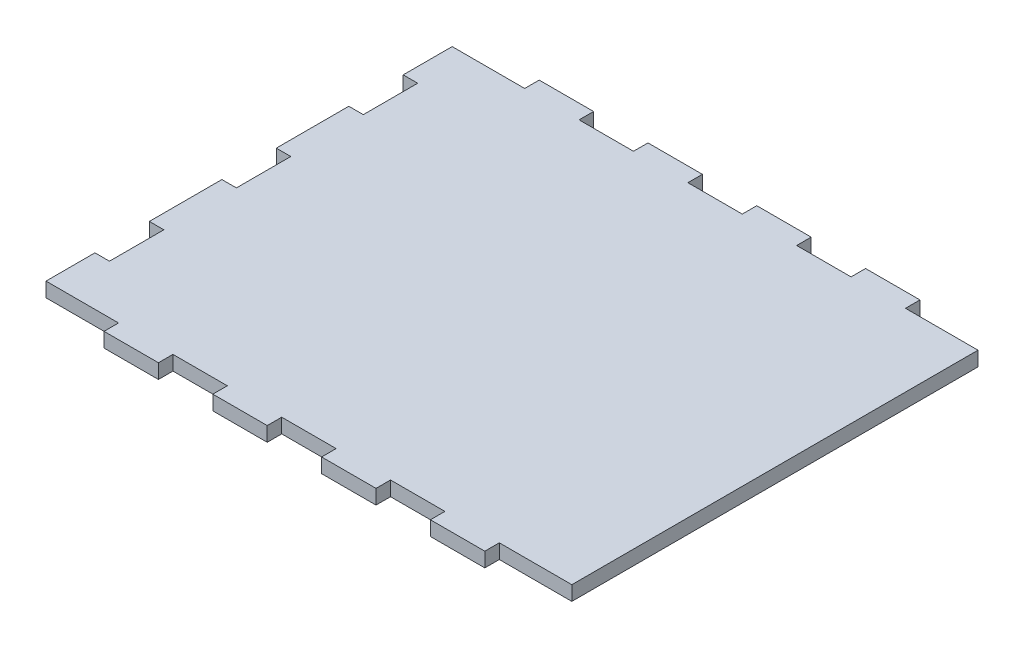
ISO-10303-21;
HEADER;
FILE_DESCRIPTION(('STEP AP214'),'2;1');
FILE_NAME('part.step','',(''),(''),'','','');
FILE_SCHEMA(('AUTOMOTIVE_DESIGN { 1 0 10303 214 1 1 1 1 }'));
ENDSEC;
DATA;
#1=APPLICATION_CONTEXT('core data for automotive mechanical design processes');
#2=APPLICATION_PROTOCOL_DEFINITION('international standard','automotive_design',2000,#1);
#3=PRODUCT_CONTEXT('',#1,'mechanical');
#4=PRODUCT('Part','Part','',(#3));
#5=PRODUCT_RELATED_PRODUCT_CATEGORY('part','',(#4));
#6=PRODUCT_DEFINITION_FORMATION('','',#4);
#7=PRODUCT_DEFINITION_CONTEXT('part definition',#1,'design');
#8=PRODUCT_DEFINITION('design','',#6,#7);
#9=PRODUCT_DEFINITION_SHAPE('','',#8);
#10=(LENGTH_UNIT() NAMED_UNIT(*) SI_UNIT(.MILLI.,.METRE.));
#11=(NAMED_UNIT(*) PLANE_ANGLE_UNIT() SI_UNIT($,.RADIAN.));
#12=(NAMED_UNIT(*) SI_UNIT($,.STERADIAN.) SOLID_ANGLE_UNIT());
#13=UNCERTAINTY_MEASURE_WITH_UNIT(LENGTH_MEASURE(1.E-05),#10,'distance_accuracy_value','');
#14=(GEOMETRIC_REPRESENTATION_CONTEXT(3) GLOBAL_UNCERTAINTY_ASSIGNED_CONTEXT((#13)) GLOBAL_UNIT_ASSIGNED_CONTEXT((#10,
#11,#12)) REPRESENTATION_CONTEXT('',''));
#15=CARTESIAN_POINT('',(0.,0.,0.));
#16=DIRECTION('',(0.,0.,1.));
#17=DIRECTION('',(1.,0.,0.));
#18=AXIS2_PLACEMENT_3D('',#15,#16,#17);
#19=CARTESIAN_POINT('',(0.,4.,0.));
#20=DIRECTION('',(1.,0.,0.));
#21=DIRECTION('',(0.,0.,-1.));
#22=AXIS2_PLACEMENT_3D('',#19,#20,#21);
#23=PLANE('',#22);
#24=DIRECTION('',(0.,1.,0.));
#25=VECTOR('',#24,1.);
#26=CARTESIAN_POINT('',(0.,0.,-116.));
#27=LINE('',#26,#25);
#28=CARTESIAN_POINT('',(0.,0.,-116.));
#29=VERTEX_POINT('',#28);
#30=CARTESIAN_POINT('',(0.,4.,-116.));
#31=VERTEX_POINT('',#30);
#32=EDGE_CURVE('E355',#29,#31,#27,.T.);
#33=ORIENTED_EDGE('',*,*,#32,.F.);
#34=DIRECTION('',(0.,0.,1.));
#35=VECTOR('',#34,1.);
#36=CARTESIAN_POINT('',(0.,0.,0.));
#37=LINE('',#36,#35);
#38=CARTESIAN_POINT('',(0.,0.,-102.5));
#39=VERTEX_POINT('',#38);
#40=EDGE_CURVE('E367',#29,#39,#37,.T.);
#41=ORIENTED_EDGE('',*,*,#40,.T.);
#42=DIRECTION('',(0.,1.,0.));
#43=VECTOR('',#42,1.);
#44=CARTESIAN_POINT('',(0.,0.,-102.5));
#45=LINE('',#44,#43);
#46=CARTESIAN_POINT('',(0.,4.,-102.5));
#47=VERTEX_POINT('',#46);
#48=EDGE_CURVE('E566',#39,#47,#45,.T.);
#49=ORIENTED_EDGE('',*,*,#48,.T.);
#50=DIRECTION('',(0.,0.,1.));
#51=VECTOR('',#50,1.);
#52=CARTESIAN_POINT('',(0.,4.,0.));
#53=LINE('',#52,#51);
#54=EDGE_CURVE('E369',#31,#47,#53,.T.);
#55=ORIENTED_EDGE('',*,*,#54,.F.);
#56=EDGE_LOOP('',(#33,#41,#49,#55));
#57=FACE_BOUND('',#56,.T.);
#58=ADVANCED_FACE('F45',(#57),#23,.F.);
#59=CARTESIAN_POINT('',(145.,4.,0.));
#60=DIRECTION('',(-1.,0.,0.));
#61=DIRECTION('',(0.,0.,1.));
#62=AXIS2_PLACEMENT_3D('',#59,#60,#61);
#63=PLANE('',#62);
#64=DIRECTION('',(0.,1.,0.));
#65=VECTOR('',#64,1.);
#66=CARTESIAN_POINT('',(145.,0.,-116.));
#67=LINE('',#66,#65);
#68=CARTESIAN_POINT('',(145.,0.,-116.));
#69=VERTEX_POINT('',#68);
#70=CARTESIAN_POINT('',(145.,4.,-116.));
#71=VERTEX_POINT('',#70);
#72=EDGE_CURVE('E485',#69,#71,#67,.T.);
#73=ORIENTED_EDGE('',*,*,#72,.T.);
#74=DIRECTION('',(0.,0.,-1.));
#75=VECTOR('',#74,1.);
#76=CARTESIAN_POINT('',(145.,4.,0.));
#77=LINE('',#76,#75);
#78=CARTESIAN_POINT('',(145.,4.,-4.));
#79=VERTEX_POINT('',#78);
#80=EDGE_CURVE('E421',#79,#71,#77,.T.);
#81=ORIENTED_EDGE('',*,*,#80,.F.);
#82=DIRECTION('',(0.,1.,0.));
#83=VECTOR('',#82,1.);
#84=CARTESIAN_POINT('',(145.,0.,-4.));
#85=LINE('',#84,#83);
#86=CARTESIAN_POINT('',(145.,0.,-4.));
#87=VERTEX_POINT('',#86);
#88=EDGE_CURVE('E747',#87,#79,#85,.T.);
#89=ORIENTED_EDGE('',*,*,#88,.F.);
#90=DIRECTION('',(0.,0.,-1.));
#91=VECTOR('',#90,1.);
#92=CARTESIAN_POINT('',(145.,0.,0.));
#93=LINE('',#92,#91);
#94=EDGE_CURVE('E837',#87,#69,#93,.T.);
#95=ORIENTED_EDGE('',*,*,#94,.T.);
#96=EDGE_LOOP('',(#73,#81,#89,#95));
#97=FACE_BOUND('',#96,.T.);
#98=ADVANCED_FACE('F883',(#97),#63,.F.);
#99=CARTESIAN_POINT('',(0.,4.,-120.));
#100=DIRECTION('',(0.,0.,1.));
#101=DIRECTION('',(1.,0.,0.));
#102=AXIS2_PLACEMENT_3D('',#99,#100,#101);
#103=PLANE('',#102);
#104=DIRECTION('',(0.,1.,0.));
#105=VECTOR('',#104,1.);
#106=CARTESIAN_POINT('',(20.,0.,-120.));
#107=LINE('',#106,#105);
#108=CARTESIAN_POINT('',(20.,0.,-120.));
#109=VERTEX_POINT('',#108);
#110=CARTESIAN_POINT('',(20.,4.,-120.));
#111=VERTEX_POINT('',#110);
#112=EDGE_CURVE('E520',#109,#111,#107,.T.);
#113=ORIENTED_EDGE('',*,*,#112,.T.);
#114=DIRECTION('',(-1.,0.,0.));
#115=VECTOR('',#114,1.);
#116=CARTESIAN_POINT('',(0.,4.,-120.));
#117=LINE('',#116,#115);
#118=CARTESIAN_POINT('',(35.,4.,-120.));
#119=VERTEX_POINT('',#118);
#120=EDGE_CURVE('E57',#119,#111,#117,.T.);
#121=ORIENTED_EDGE('',*,*,#120,.F.);
#122=DIRECTION('',(0.,1.,0.));
#123=VECTOR('',#122,1.);
#124=CARTESIAN_POINT('',(35.,0.,-120.));
#125=LINE('',#124,#123);
#126=CARTESIAN_POINT('',(35.,0.,-120.));
#127=VERTEX_POINT('',#126);
#128=EDGE_CURVE('E362',#127,#119,#125,.T.);
#129=ORIENTED_EDGE('',*,*,#128,.F.);
#130=DIRECTION('',(-1.,0.,0.));
#131=VECTOR('',#130,1.);
#132=CARTESIAN_POINT('',(0.,0.,-120.));
#133=LINE('',#132,#131);
#134=EDGE_CURVE('E49',#127,#109,#133,.T.);
#135=ORIENTED_EDGE('',*,*,#134,.T.);
#136=EDGE_LOOP('',(#113,#121,#129,#135));
#137=FACE_BOUND('',#136,.T.);
#138=ADVANCED_FACE('F889',(#137),#103,.F.);
#139=DIRECTION('',(0.,1.,0.));
#140=VECTOR('',#139,1.);
#141=CARTESIAN_POINT('',(50.,0.,-120.));
#142=LINE('',#141,#140);
#143=CARTESIAN_POINT('',(50.,0.,-120.));
#144=VERTEX_POINT('',#143);
#145=CARTESIAN_POINT('',(50.,4.,-120.));
#146=VERTEX_POINT('',#145);
#147=EDGE_CURVE('E939',#144,#146,#142,.T.);
#148=ORIENTED_EDGE('',*,*,#147,.T.);
#149=CARTESIAN_POINT('',(65.,4.,-120.));
#150=VERTEX_POINT('',#149);
#151=EDGE_CURVE('E426',#150,#146,#117,.T.);
#152=ORIENTED_EDGE('',*,*,#151,.F.);
#153=DIRECTION('',(0.,1.,0.));
#154=VECTOR('',#153,1.);
#155=CARTESIAN_POINT('',(65.,0.,-120.));
#156=LINE('',#155,#154);
#157=CARTESIAN_POINT('',(65.,0.,-120.));
#158=VERTEX_POINT('',#157);
#159=EDGE_CURVE('E458',#158,#150,#156,.T.);
#160=ORIENTED_EDGE('',*,*,#159,.F.);
#161=EDGE_CURVE('E925',#158,#144,#133,.T.);
#162=ORIENTED_EDGE('',*,*,#161,.T.);
#163=EDGE_LOOP('',(#148,#152,#160,#162));
#164=FACE_BOUND('',#163,.T.);
#165=ADVANCED_FACE('F938',(#164),#103,.F.);
#166=DIRECTION('',(0.,1.,0.));
#167=VECTOR('',#166,1.);
#168=CARTESIAN_POINT('',(80.,0.,-120.));
#169=LINE('',#168,#167);
#170=CARTESIAN_POINT('',(80.,0.,-120.));
#171=VERTEX_POINT('',#170);
#172=CARTESIAN_POINT('',(80.,4.,-120.));
#173=VERTEX_POINT('',#172);
#174=EDGE_CURVE('E452',#171,#173,#169,.T.);
#175=ORIENTED_EDGE('',*,*,#174,.T.);
#176=CARTESIAN_POINT('',(95.,4.,-120.));
#177=VERTEX_POINT('',#176);
#178=EDGE_CURVE('E55',#177,#173,#117,.T.);
#179=ORIENTED_EDGE('',*,*,#178,.F.);
#180=DIRECTION('',(0.,1.,0.));
#181=VECTOR('',#180,1.);
#182=CARTESIAN_POINT('',(95.,0.,-120.));
#183=LINE('',#182,#181);
#184=CARTESIAN_POINT('',(95.,0.,-120.));
#185=VERTEX_POINT('',#184);
#186=EDGE_CURVE('E450',#185,#177,#183,.T.);
#187=ORIENTED_EDGE('',*,*,#186,.F.);
#188=EDGE_CURVE('E453',#185,#171,#133,.T.);
#189=ORIENTED_EDGE('',*,*,#188,.T.);
#190=EDGE_LOOP('',(#175,#179,#187,#189));
#191=FACE_BOUND('',#190,.T.);
#192=ADVANCED_FACE('F448',(#191),#103,.F.);
#193=DIRECTION('',(0.,1.,0.));
#194=VECTOR('',#193,1.);
#195=CARTESIAN_POINT('',(125.,0.,-120.));
#196=LINE('',#195,#194);
#197=CARTESIAN_POINT('',(125.,0.,-120.));
#198=VERTEX_POINT('',#197);
#199=CARTESIAN_POINT('',(125.,4.,-120.));
#200=VERTEX_POINT('',#199);
#201=EDGE_CURVE('E481',#198,#200,#196,.T.);
#202=ORIENTED_EDGE('',*,*,#201,.F.);
#203=CARTESIAN_POINT('',(110.,0.,-120.));
#204=VERTEX_POINT('',#203);
#205=EDGE_CURVE('E918',#198,#204,#133,.T.);
#206=ORIENTED_EDGE('',*,*,#205,.T.);
#207=DIRECTION('',(0.,1.,0.));
#208=VECTOR('',#207,1.);
#209=CARTESIAN_POINT('',(110.,0.,-120.));
#210=LINE('',#209,#208);
#211=CARTESIAN_POINT('',(110.,4.,-120.));
#212=VERTEX_POINT('',#211);
#213=EDGE_CURVE('E505',#204,#212,#210,.T.);
#214=ORIENTED_EDGE('',*,*,#213,.T.);
#215=EDGE_CURVE('E11',#200,#212,#117,.T.);
#216=ORIENTED_EDGE('',*,*,#215,.F.);
#217=EDGE_LOOP('',(#202,#206,#214,#216));
#218=FACE_BOUND('',#217,.T.);
#219=ADVANCED_FACE('F1078',(#218),#103,.F.);
#220=CARTESIAN_POINT('',(0.,4.,0.));
#221=DIRECTION('',(0.,-1.,0.));
#222=DIRECTION('',(0.,0.,-1.));
#223=AXIS2_PLACEMENT_3D('',#220,#221,#222);
#224=PLANE('',#223);
#225=DIRECTION('',(0.,0.,-1.));
#226=VECTOR('',#225,1.);
#227=CARTESIAN_POINT('',(20.,4.,0.));
#228=LINE('',#227,#226);
#229=CARTESIAN_POINT('',(20.,4.,-116.));
#230=VERTEX_POINT('',#229);
#231=EDGE_CURVE('E551',#230,#111,#228,.T.);
#232=ORIENTED_EDGE('',*,*,#231,.F.);
#233=DIRECTION('',(1.,0.,0.));
#234=VECTOR('',#233,1.);
#235=CARTESIAN_POINT('',(0.,4.,-116.));
#236=LINE('',#235,#234);
#237=EDGE_CURVE('E548',#31,#230,#236,.T.);
#238=ORIENTED_EDGE('',*,*,#237,.F.);
#239=ORIENTED_EDGE('',*,*,#54,.T.);
#240=DIRECTION('',(1.,0.,0.));
#241=VECTOR('',#240,1.);
#242=CARTESIAN_POINT('',(3.55618312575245E-13,4.,-102.5));
#243=LINE('',#242,#241);
#244=CARTESIAN_POINT('',(4.,4.,-102.5));
#245=VERTEX_POINT('',#244);
#246=EDGE_CURVE('E663',#47,#245,#243,.T.);
#247=ORIENTED_EDGE('',*,*,#246,.T.);
#248=DIRECTION('',(0.,0.,1.));
#249=VECTOR('',#248,1.);
#250=CARTESIAN_POINT('',(4.00000000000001,4.,0.));
#251=LINE('',#250,#249);
#252=CARTESIAN_POINT('',(4.,4.,-87.5));
#253=VERTEX_POINT('',#252);
#254=EDGE_CURVE('E659',#245,#253,#251,.T.);
#255=ORIENTED_EDGE('',*,*,#254,.T.);
#256=DIRECTION('',(-1.,0.,0.));
#257=VECTOR('',#256,1.);
#258=CARTESIAN_POINT('',(0.,4.,-87.5));
#259=LINE('',#258,#257);
#260=CARTESIAN_POINT('',(0.,4.,-87.5));
#261=VERTEX_POINT('',#260);
#262=EDGE_CURVE('E655',#253,#261,#259,.T.);
#263=ORIENTED_EDGE('',*,*,#262,.T.);
#264=CARTESIAN_POINT('',(0.,4.,-67.5));
#265=VERTEX_POINT('',#264);
#266=EDGE_CURVE('E414',#261,#265,#53,.T.);
#267=ORIENTED_EDGE('',*,*,#266,.T.);
#268=DIRECTION('',(1.,0.,0.));
#269=VECTOR('',#268,1.);
#270=CARTESIAN_POINT('',(0.,4.,-67.5));
#271=LINE('',#270,#269);
#272=CARTESIAN_POINT('',(4.,4.,-67.5));
#273=VERTEX_POINT('',#272);
#274=EDGE_CURVE('E651',#265,#273,#271,.T.);
#275=ORIENTED_EDGE('',*,*,#274,.T.);
#276=DIRECTION('',(0.,0.,1.));
#277=VECTOR('',#276,1.);
#278=CARTESIAN_POINT('',(4.00000000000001,4.,0.));
#279=LINE('',#278,#277);
#280=CARTESIAN_POINT('',(4.,4.,-52.5));
#281=VERTEX_POINT('',#280);
#282=EDGE_CURVE('E647',#273,#281,#279,.T.);
#283=ORIENTED_EDGE('',*,*,#282,.T.);
#284=DIRECTION('',(-1.,0.,0.));
#285=VECTOR('',#284,1.);
#286=CARTESIAN_POINT('',(0.,4.,-52.5));
#287=LINE('',#286,#285);
#288=CARTESIAN_POINT('',(0.,4.,-52.5));
#289=VERTEX_POINT('',#288);
#290=EDGE_CURVE('E643',#281,#289,#287,.T.);
#291=ORIENTED_EDGE('',*,*,#290,.T.);
#292=CARTESIAN_POINT('',(0.,4.,-32.5));
#293=VERTEX_POINT('',#292);
#294=EDGE_CURVE('E912',#289,#293,#53,.T.);
#295=ORIENTED_EDGE('',*,*,#294,.T.);
#296=DIRECTION('',(1.,0.,0.));
#297=VECTOR('',#296,1.);
#298=CARTESIAN_POINT('',(0.,4.,-32.5));
#299=LINE('',#298,#297);
#300=CARTESIAN_POINT('',(4.,4.,-32.5));
#301=VERTEX_POINT('',#300);
#302=EDGE_CURVE('E639',#293,#301,#299,.T.);
#303=ORIENTED_EDGE('',*,*,#302,.T.);
#304=DIRECTION('',(0.,0.,1.));
#305=VECTOR('',#304,1.);
#306=CARTESIAN_POINT('',(4.00000000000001,4.,0.));
#307=LINE('',#306,#305);
#308=CARTESIAN_POINT('',(4.,4.,-17.5));
#309=VERTEX_POINT('',#308);
#310=EDGE_CURVE('E635',#301,#309,#307,.T.);
#311=ORIENTED_EDGE('',*,*,#310,.T.);
#312=DIRECTION('',(-1.,0.,0.));
#313=VECTOR('',#312,1.);
#314=CARTESIAN_POINT('',(0.,4.,-17.5));
#315=LINE('',#314,#313);
#316=CARTESIAN_POINT('',(0.,4.,-17.5));
#317=VERTEX_POINT('',#316);
#318=EDGE_CURVE('E569',#309,#317,#315,.T.);
#319=ORIENTED_EDGE('',*,*,#318,.T.);
#320=CARTESIAN_POINT('',(0.,4.,-4.));
#321=VERTEX_POINT('',#320);
#322=EDGE_CURVE('E415',#317,#321,#53,.T.);
#323=ORIENTED_EDGE('',*,*,#322,.T.);
#324=DIRECTION('',(1.,0.,0.));
#325=VECTOR('',#324,1.);
#326=CARTESIAN_POINT('',(0.,4.,-4.));
#327=LINE('',#326,#325);
#328=CARTESIAN_POINT('',(20.,4.,-4.));
#329=VERTEX_POINT('',#328);
#330=EDGE_CURVE('E391',#321,#329,#327,.T.);
#331=ORIENTED_EDGE('',*,*,#330,.T.);
#332=DIRECTION('',(0.,0.,1.));
#333=VECTOR('',#332,1.);
#334=CARTESIAN_POINT('',(20.,4.,0.));
#335=LINE('',#334,#333);
#336=CARTESIAN_POINT('',(20.,4.,0.));
#337=VERTEX_POINT('',#336);
#338=EDGE_CURVE('E401',#329,#337,#335,.T.);
#339=ORIENTED_EDGE('',*,*,#338,.T.);
#340=DIRECTION('',(1.,0.,0.));
#341=VECTOR('',#340,1.);
#342=CARTESIAN_POINT('',(0.,4.,0.));
#343=LINE('',#342,#341);
#344=CARTESIAN_POINT('',(35.,4.,0.));
#345=VERTEX_POINT('',#344);
#346=EDGE_CURVE('E420',#337,#345,#343,.T.);
#347=ORIENTED_EDGE('',*,*,#346,.T.);
#348=DIRECTION('',(0.,0.,-1.));
#349=VECTOR('',#348,1.);
#350=CARTESIAN_POINT('',(35.,4.,0.));
#351=LINE('',#350,#349);
#352=CARTESIAN_POINT('',(35.,4.,-4.));
#353=VERTEX_POINT('',#352);
#354=EDGE_CURVE('E407',#345,#353,#351,.T.);
#355=ORIENTED_EDGE('',*,*,#354,.T.);
#356=DIRECTION('',(1.,0.,0.));
#357=VECTOR('',#356,1.);
#358=CARTESIAN_POINT('',(0.,4.,-4.));
#359=LINE('',#358,#357);
#360=CARTESIAN_POINT('',(50.,4.,-4.));
#361=VERTEX_POINT('',#360);
#362=EDGE_CURVE('E821',#353,#361,#359,.T.);
#363=ORIENTED_EDGE('',*,*,#362,.T.);
#364=DIRECTION('',(0.,0.,1.));
#365=VECTOR('',#364,1.);
#366=CARTESIAN_POINT('',(50.,4.,0.));
#367=LINE('',#366,#365);
#368=CARTESIAN_POINT('',(50.,4.,0.));
#369=VERTEX_POINT('',#368);
#370=EDGE_CURVE('E817',#361,#369,#367,.T.);
#371=ORIENTED_EDGE('',*,*,#370,.T.);
#372=CARTESIAN_POINT('',(65.,4.,0.));
#373=VERTEX_POINT('',#372);
#374=EDGE_CURVE('E858',#369,#373,#343,.T.);
#375=ORIENTED_EDGE('',*,*,#374,.T.);
#376=DIRECTION('',(0.,0.,-1.));
#377=VECTOR('',#376,1.);
#378=CARTESIAN_POINT('',(65.,4.,0.));
#379=LINE('',#378,#377);
#380=CARTESIAN_POINT('',(65.,4.,-4.));
#381=VERTEX_POINT('',#380);
#382=EDGE_CURVE('E813',#373,#381,#379,.T.);
#383=ORIENTED_EDGE('',*,*,#382,.T.);
#384=DIRECTION('',(1.,0.,0.));
#385=VECTOR('',#384,1.);
#386=CARTESIAN_POINT('',(0.,4.,-4.));
#387=LINE('',#386,#385);
#388=CARTESIAN_POINT('',(80.,4.,-4.));
#389=VERTEX_POINT('',#388);
#390=EDGE_CURVE('E809',#381,#389,#387,.T.);
#391=ORIENTED_EDGE('',*,*,#390,.T.);
#392=DIRECTION('',(0.,0.,1.));
#393=VECTOR('',#392,1.);
#394=CARTESIAN_POINT('',(80.,4.,0.));
#395=LINE('',#394,#393);
#396=CARTESIAN_POINT('',(80.,4.,0.));
#397=VERTEX_POINT('',#396);
#398=EDGE_CURVE('E805',#389,#397,#395,.T.);
#399=ORIENTED_EDGE('',*,*,#398,.T.);
#400=CARTESIAN_POINT('',(95.,4.,0.));
#401=VERTEX_POINT('',#400);
#402=EDGE_CURVE('E419',#397,#401,#343,.T.);
#403=ORIENTED_EDGE('',*,*,#402,.T.);
#404=DIRECTION('',(0.,0.,-1.));
#405=VECTOR('',#404,1.);
#406=CARTESIAN_POINT('',(95.,4.,0.));
#407=LINE('',#406,#405);
#408=CARTESIAN_POINT('',(95.,4.,-4.));
#409=VERTEX_POINT('',#408);
#410=EDGE_CURVE('E793',#401,#409,#407,.T.);
#411=ORIENTED_EDGE('',*,*,#410,.T.);
#412=DIRECTION('',(1.,0.,0.));
#413=VECTOR('',#412,1.);
#414=CARTESIAN_POINT('',(0.,4.,-4.));
#415=LINE('',#414,#413);
#416=CARTESIAN_POINT('',(110.,4.,-4.));
#417=VERTEX_POINT('',#416);
#418=EDGE_CURVE('E789',#409,#417,#415,.T.);
#419=ORIENTED_EDGE('',*,*,#418,.T.);
#420=DIRECTION('',(0.,0.,1.));
#421=VECTOR('',#420,1.);
#422=CARTESIAN_POINT('',(110.,4.,0.));
#423=LINE('',#422,#421);
#424=CARTESIAN_POINT('',(110.,4.,0.));
#425=VERTEX_POINT('',#424);
#426=EDGE_CURVE('E681',#417,#425,#423,.T.);
#427=ORIENTED_EDGE('',*,*,#426,.T.);
#428=CARTESIAN_POINT('',(125.,4.,0.));
#429=VERTEX_POINT('',#428);
#430=EDGE_CURVE('E413',#425,#429,#343,.T.);
#431=ORIENTED_EDGE('',*,*,#430,.T.);
#432=DIRECTION('',(0.,0.,-1.));
#433=VECTOR('',#432,1.);
#434=CARTESIAN_POINT('',(125.,4.,0.));
#435=LINE('',#434,#433);
#436=CARTESIAN_POINT('',(125.,4.,-4.));
#437=VERTEX_POINT('',#436);
#438=EDGE_CURVE('E801',#429,#437,#435,.T.);
#439=ORIENTED_EDGE('',*,*,#438,.T.);
#440=DIRECTION('',(1.,0.,0.));
#441=VECTOR('',#440,1.);
#442=CARTESIAN_POINT('',(0.,4.,-4.));
#443=LINE('',#442,#441);
#444=EDGE_CURVE('E797',#437,#79,#443,.T.);
#445=ORIENTED_EDGE('',*,*,#444,.T.);
#446=ORIENTED_EDGE('',*,*,#80,.T.);
#447=DIRECTION('',(1.,0.,0.));
#448=VECTOR('',#447,1.);
#449=CARTESIAN_POINT('',(0.,4.,-116.));
#450=LINE('',#449,#448);
#451=CARTESIAN_POINT('',(125.,4.,-116.));
#452=VERTEX_POINT('',#451);
#453=EDGE_CURVE('E525',#452,#71,#450,.T.);
#454=ORIENTED_EDGE('',*,*,#453,.F.);
#455=DIRECTION('',(0.,0.,1.));
#456=VECTOR('',#455,1.);
#457=CARTESIAN_POINT('',(125.,4.,0.));
#458=LINE('',#457,#456);
#459=EDGE_CURVE('E528',#200,#452,#458,.T.);
#460=ORIENTED_EDGE('',*,*,#459,.F.);
#461=ORIENTED_EDGE('',*,*,#215,.T.);
#462=DIRECTION('',(0.,0.,-1.));
#463=VECTOR('',#462,1.);
#464=CARTESIAN_POINT('',(110.,4.,0.));
#465=LINE('',#464,#463);
#466=CARTESIAN_POINT('',(110.,4.,-116.));
#467=VERTEX_POINT('',#466);
#468=EDGE_CURVE('E519',#467,#212,#465,.T.);
#469=ORIENTED_EDGE('',*,*,#468,.F.);
#470=DIRECTION('',(1.,0.,0.));
#471=VECTOR('',#470,1.);
#472=CARTESIAN_POINT('',(0.,4.,-116.));
#473=LINE('',#472,#471);
#474=CARTESIAN_POINT('',(95.,4.,-116.));
#475=VERTEX_POINT('',#474);
#476=EDGE_CURVE('E516',#475,#467,#473,.T.);
#477=ORIENTED_EDGE('',*,*,#476,.F.);
#478=DIRECTION('',(0.,0.,1.));
#479=VECTOR('',#478,1.);
#480=CARTESIAN_POINT('',(95.,4.,0.));
#481=LINE('',#480,#479);
#482=EDGE_CURVE('E444',#177,#475,#481,.T.);
#483=ORIENTED_EDGE('',*,*,#482,.F.);
#484=ORIENTED_EDGE('',*,*,#178,.T.);
#485=DIRECTION('',(0.,0.,-1.));
#486=VECTOR('',#485,1.);
#487=CARTESIAN_POINT('',(80.,4.,0.));
#488=LINE('',#487,#486);
#489=CARTESIAN_POINT('',(80.,4.,-116.));
#490=VERTEX_POINT('',#489);
#491=EDGE_CURVE('E442',#490,#173,#488,.T.);
#492=ORIENTED_EDGE('',*,*,#491,.F.);
#493=DIRECTION('',(1.,0.,0.));
#494=VECTOR('',#493,1.);
#495=CARTESIAN_POINT('',(0.,4.,-116.));
#496=LINE('',#495,#494);
#497=CARTESIAN_POINT('',(65.,4.,-116.));
#498=VERTEX_POINT('',#497);
#499=EDGE_CURVE('E531',#498,#490,#496,.T.);
#500=ORIENTED_EDGE('',*,*,#499,.F.);
#501=DIRECTION('',(0.,0.,1.));
#502=VECTOR('',#501,1.);
#503=CARTESIAN_POINT('',(65.,4.,0.));
#504=LINE('',#503,#502);
#505=EDGE_CURVE('E536',#150,#498,#504,.T.);
#506=ORIENTED_EDGE('',*,*,#505,.F.);
#507=ORIENTED_EDGE('',*,*,#151,.T.);
#508=DIRECTION('',(0.,0.,-1.));
#509=VECTOR('',#508,1.);
#510=CARTESIAN_POINT('',(50.,4.,0.));
#511=LINE('',#510,#509);
#512=CARTESIAN_POINT('',(50.,4.,-116.));
#513=VERTEX_POINT('',#512);
#514=EDGE_CURVE('E542',#513,#146,#511,.T.);
#515=ORIENTED_EDGE('',*,*,#514,.F.);
#516=DIRECTION('',(1.,0.,0.));
#517=VECTOR('',#516,1.);
#518=CARTESIAN_POINT('',(0.,4.,-116.));
#519=LINE('',#518,#517);
#520=CARTESIAN_POINT('',(35.,4.,-116.));
#521=VERTEX_POINT('',#520);
#522=EDGE_CURVE('E539',#521,#513,#519,.T.);
#523=ORIENTED_EDGE('',*,*,#522,.F.);
#524=DIRECTION('',(0.,0.,1.));
#525=VECTOR('',#524,1.);
#526=CARTESIAN_POINT('',(35.,4.,0.));
#527=LINE('',#526,#525);
#528=EDGE_CURVE('E545',#119,#521,#527,.T.);
#529=ORIENTED_EDGE('',*,*,#528,.F.);
#530=ORIENTED_EDGE('',*,*,#120,.T.);
#531=EDGE_LOOP('',(#232,#238,#239,#247,#255,#263,#267,#275,#283,#291,#295,#303,#311,#319,#323,
#331,#339,#347,#355,#363,#371,#375,#383,#391,#399,#403,#411,#419,#427,#431,#439,#445,#446,#454,
#460,#461,#469,#477,#483,#484,#492,#500,#506,#507,#515,#523,#529,#530));
#532=FACE_BOUND('',#531,.T.);
#533=ADVANCED_FACE('F440',(#532),#224,.F.);
#534=CARTESIAN_POINT('',(0.,0.,0.));
#535=DIRECTION('',(0.,-1.,0.));
#536=DIRECTION('',(0.,0.,-1.));
#537=AXIS2_PLACEMENT_3D('',#534,#535,#536);
#538=PLANE('',#537);
#539=DIRECTION('',(-1.,0.,0.));
#540=VECTOR('',#539,1.);
#541=CARTESIAN_POINT('',(0.,0.,-116.));
#542=LINE('',#541,#540);
#543=CARTESIAN_POINT('',(20.,0.,-116.));
#544=VERTEX_POINT('',#543);
#545=EDGE_CURVE('E352',#544,#29,#542,.T.);
#546=ORIENTED_EDGE('',*,*,#545,.F.);
#547=DIRECTION('',(0.,0.,1.));
#548=VECTOR('',#547,1.);
#549=CARTESIAN_POINT('',(20.,0.,-120.));
#550=LINE('',#549,#548);
#551=EDGE_CURVE('E361',#109,#544,#550,.T.);
#552=ORIENTED_EDGE('',*,*,#551,.F.);
#553=ORIENTED_EDGE('',*,*,#134,.F.);
#554=DIRECTION('',(0.,0.,-1.));
#555=VECTOR('',#554,1.);
#556=CARTESIAN_POINT('',(35.,0.,-120.));
#557=LINE('',#556,#555);
#558=CARTESIAN_POINT('',(35.,0.,-116.));
#559=VERTEX_POINT('',#558);
#560=EDGE_CURVE('E463',#559,#127,#557,.T.);
#561=ORIENTED_EDGE('',*,*,#560,.F.);
#562=DIRECTION('',(-1.,0.,0.));
#563=VECTOR('',#562,1.);
#564=CARTESIAN_POINT('',(35.,0.,-116.));
#565=LINE('',#564,#563);
#566=CARTESIAN_POINT('',(50.,0.,-116.));
#567=VERTEX_POINT('',#566);
#568=EDGE_CURVE('E946',#567,#559,#565,.T.);
#569=ORIENTED_EDGE('',*,*,#568,.F.);
#570=DIRECTION('',(0.,0.,1.));
#571=VECTOR('',#570,1.);
#572=CARTESIAN_POINT('',(50.,0.,-120.));
#573=LINE('',#572,#571);
#574=EDGE_CURVE('E944',#144,#567,#573,.T.);
#575=ORIENTED_EDGE('',*,*,#574,.F.);
#576=ORIENTED_EDGE('',*,*,#161,.F.);
#577=DIRECTION('',(0.,0.,-1.));
#578=VECTOR('',#577,1.);
#579=CARTESIAN_POINT('',(65.,0.,-120.));
#580=LINE('',#579,#578);
#581=CARTESIAN_POINT('',(65.,0.,-116.));
#582=VERTEX_POINT('',#581);
#583=EDGE_CURVE('E484',#582,#158,#580,.T.);
#584=ORIENTED_EDGE('',*,*,#583,.F.);
#585=DIRECTION('',(-1.,0.,0.));
#586=VECTOR('',#585,1.);
#587=CARTESIAN_POINT('',(65.,0.,-116.));
#588=LINE('',#587,#586);
#589=CARTESIAN_POINT('',(80.,0.,-116.));
#590=VERTEX_POINT('',#589);
#591=EDGE_CURVE('E966',#590,#582,#588,.T.);
#592=ORIENTED_EDGE('',*,*,#591,.F.);
#593=DIRECTION('',(0.,0.,1.));
#594=VECTOR('',#593,1.);
#595=CARTESIAN_POINT('',(80.,0.,-120.));
#596=LINE('',#595,#594);
#597=EDGE_CURVE('E473',#171,#590,#596,.T.);
#598=ORIENTED_EDGE('',*,*,#597,.F.);
#599=ORIENTED_EDGE('',*,*,#188,.F.);
#600=DIRECTION('',(0.,0.,-1.));
#601=VECTOR('',#600,1.);
#602=CARTESIAN_POINT('',(95.,0.,-120.));
#603=LINE('',#602,#601);
#604=CARTESIAN_POINT('',(95.,0.,-116.));
#605=VERTEX_POINT('',#604);
#606=EDGE_CURVE('E492',#605,#185,#603,.T.);
#607=ORIENTED_EDGE('',*,*,#606,.F.);
#608=DIRECTION('',(-1.,0.,0.));
#609=VECTOR('',#608,1.);
#610=CARTESIAN_POINT('',(95.,0.,-116.));
#611=LINE('',#610,#609);
#612=CARTESIAN_POINT('',(110.,0.,-116.));
#613=VERTEX_POINT('',#612);
#614=EDGE_CURVE('E495',#613,#605,#611,.T.);
#615=ORIENTED_EDGE('',*,*,#614,.F.);
#616=DIRECTION('',(0.,0.,1.));
#617=VECTOR('',#616,1.);
#618=CARTESIAN_POINT('',(110.,0.,-120.));
#619=LINE('',#618,#617);
#620=EDGE_CURVE('E498',#204,#613,#619,.T.);
#621=ORIENTED_EDGE('',*,*,#620,.F.);
#622=ORIENTED_EDGE('',*,*,#205,.F.);
#623=DIRECTION('',(0.,0.,-1.));
#624=VECTOR('',#623,1.);
#625=CARTESIAN_POINT('',(125.,0.,-120.));
#626=LINE('',#625,#624);
#627=CARTESIAN_POINT('',(125.,0.,-116.));
#628=VERTEX_POINT('',#627);
#629=EDGE_CURVE('E474',#628,#198,#626,.T.);
#630=ORIENTED_EDGE('',*,*,#629,.F.);
#631=DIRECTION('',(-1.,0.,0.));
#632=VECTOR('',#631,1.);
#633=CARTESIAN_POINT('',(125.,0.,-116.));
#634=LINE('',#633,#632);
#635=EDGE_CURVE('E477',#69,#628,#634,.T.);
#636=ORIENTED_EDGE('',*,*,#635,.F.);
#637=ORIENTED_EDGE('',*,*,#94,.F.);
#638=DIRECTION('',(-1.,0.,0.));
#639=VECTOR('',#638,1.);
#640=CARTESIAN_POINT('',(125.,0.,-4.));
#641=LINE('',#640,#639);
#642=CARTESIAN_POINT('',(125.,0.,-4.));
#643=VERTEX_POINT('',#642);
#644=EDGE_CURVE('E746',#87,#643,#641,.T.);
#645=ORIENTED_EDGE('',*,*,#644,.T.);
#646=DIRECTION('',(0.,0.,1.));
#647=VECTOR('',#646,1.);
#648=CARTESIAN_POINT('',(125.,0.,0.));
#649=LINE('',#648,#647);
#650=CARTESIAN_POINT('',(125.,0.,0.));
#651=VERTEX_POINT('',#650);
#652=EDGE_CURVE('E731',#643,#651,#649,.T.);
#653=ORIENTED_EDGE('',*,*,#652,.T.);
#654=DIRECTION('',(1.,0.,0.));
#655=VECTOR('',#654,1.);
#656=CARTESIAN_POINT('',(0.,0.,0.));
#657=LINE('',#656,#655);
#658=CARTESIAN_POINT('',(110.,0.,0.));
#659=VERTEX_POINT('',#658);
#660=EDGE_CURVE('E378',#659,#651,#657,.T.);
#661=ORIENTED_EDGE('',*,*,#660,.F.);
#662=DIRECTION('',(0.,0.,-1.));
#663=VECTOR('',#662,1.);
#664=CARTESIAN_POINT('',(110.,0.,0.));
#665=LINE('',#664,#663);
#666=CARTESIAN_POINT('',(110.,0.,-4.));
#667=VERTEX_POINT('',#666);
#668=EDGE_CURVE('E779',#659,#667,#665,.T.);
#669=ORIENTED_EDGE('',*,*,#668,.T.);
#670=DIRECTION('',(-1.,0.,0.));
#671=VECTOR('',#670,1.);
#672=CARTESIAN_POINT('',(95.,0.,-4.));
#673=LINE('',#672,#671);
#674=CARTESIAN_POINT('',(95.,0.,-4.));
#675=VERTEX_POINT('',#674);
#676=EDGE_CURVE('E765',#667,#675,#673,.T.);
#677=ORIENTED_EDGE('',*,*,#676,.T.);
#678=DIRECTION('',(0.,0.,1.));
#679=VECTOR('',#678,1.);
#680=CARTESIAN_POINT('',(95.,0.,0.));
#681=LINE('',#680,#679);
#682=CARTESIAN_POINT('',(95.,0.,0.));
#683=VERTEX_POINT('',#682);
#684=EDGE_CURVE('E754',#675,#683,#681,.T.);
#685=ORIENTED_EDGE('',*,*,#684,.T.);
#686=CARTESIAN_POINT('',(80.,0.,0.));
#687=VERTEX_POINT('',#686);
#688=EDGE_CURVE('E385',#687,#683,#657,.T.);
#689=ORIENTED_EDGE('',*,*,#688,.F.);
#690=DIRECTION('',(0.,0.,-1.));
#691=VECTOR('',#690,1.);
#692=CARTESIAN_POINT('',(80.,0.,0.));
#693=LINE('',#692,#691);
#694=CARTESIAN_POINT('',(80.,0.,-4.));
#695=VERTEX_POINT('',#694);
#696=EDGE_CURVE('E735',#687,#695,#693,.T.);
#697=ORIENTED_EDGE('',*,*,#696,.T.);
#698=DIRECTION('',(-1.,0.,0.));
#699=VECTOR('',#698,1.);
#700=CARTESIAN_POINT('',(65.,0.,-4.));
#701=LINE('',#700,#699);
#702=CARTESIAN_POINT('',(65.,0.,-4.));
#703=VERTEX_POINT('',#702);
#704=EDGE_CURVE('E719',#695,#703,#701,.T.);
#705=ORIENTED_EDGE('',*,*,#704,.T.);
#706=DIRECTION('',(0.,0.,1.));
#707=VECTOR('',#706,1.);
#708=CARTESIAN_POINT('',(65.,0.,0.));
#709=LINE('',#708,#707);
#710=CARTESIAN_POINT('',(65.,0.,0.));
#711=VERTEX_POINT('',#710);
#712=EDGE_CURVE('E704',#703,#711,#709,.T.);
#713=ORIENTED_EDGE('',*,*,#712,.T.);
#714=CARTESIAN_POINT('',(50.,0.,0.));
#715=VERTEX_POINT('',#714);
#716=EDGE_CURVE('E838',#715,#711,#657,.T.);
#717=ORIENTED_EDGE('',*,*,#716,.F.);
#718=DIRECTION('',(0.,0.,-1.));
#719=VECTOR('',#718,1.);
#720=CARTESIAN_POINT('',(50.,0.,0.));
#721=LINE('',#720,#719);
#722=CARTESIAN_POINT('',(50.,0.,-4.));
#723=VERTEX_POINT('',#722);
#724=EDGE_CURVE('E708',#715,#723,#721,.T.);
#725=ORIENTED_EDGE('',*,*,#724,.T.);
#726=DIRECTION('',(-1.,0.,0.));
#727=VECTOR('',#726,1.);
#728=CARTESIAN_POINT('',(35.,0.,-4.));
#729=LINE('',#728,#727);
#730=CARTESIAN_POINT('',(35.,0.,-4.));
#731=VERTEX_POINT('',#730);
#732=EDGE_CURVE('E692',#723,#731,#729,.T.);
#733=ORIENTED_EDGE('',*,*,#732,.T.);
#734=DIRECTION('',(0.,0.,1.));
#735=VECTOR('',#734,1.);
#736=CARTESIAN_POINT('',(35.,0.,0.));
#737=LINE('',#736,#735);
#738=CARTESIAN_POINT('',(35.,0.,0.));
#739=VERTEX_POINT('',#738);
#740=EDGE_CURVE('E673',#731,#739,#737,.T.);
#741=ORIENTED_EDGE('',*,*,#740,.T.);
#742=CARTESIAN_POINT('',(20.,0.,0.));
#743=VERTEX_POINT('',#742);
#744=EDGE_CURVE('E387',#743,#739,#657,.T.);
#745=ORIENTED_EDGE('',*,*,#744,.F.);
#746=DIRECTION('',(0.,0.,-1.));
#747=VECTOR('',#746,1.);
#748=CARTESIAN_POINT('',(20.,0.,0.));
#749=LINE('',#748,#747);
#750=CARTESIAN_POINT('',(20.,0.,-4.));
#751=VERTEX_POINT('',#750);
#752=EDGE_CURVE('E668',#743,#751,#749,.T.);
#753=ORIENTED_EDGE('',*,*,#752,.T.);
#754=DIRECTION('',(-1.,0.,0.));
#755=VECTOR('',#754,1.);
#756=CARTESIAN_POINT('',(0.,0.,-4.));
#757=LINE('',#756,#755);
#758=CARTESIAN_POINT('',(0.,0.,-4.));
#759=VERTEX_POINT('',#758);
#760=EDGE_CURVE('E672',#751,#759,#757,.T.);
#761=ORIENTED_EDGE('',*,*,#760,.T.);
#762=CARTESIAN_POINT('',(0.,0.,-17.5));
#763=VERTEX_POINT('',#762);
#764=EDGE_CURVE('E381',#763,#759,#37,.T.);
#765=ORIENTED_EDGE('',*,*,#764,.F.);
#766=DIRECTION('',(1.,0.,0.));
#767=VECTOR('',#766,1.);
#768=CARTESIAN_POINT('',(0.,0.,-17.5));
#769=LINE('',#768,#767);
#770=CARTESIAN_POINT('',(4.,0.,-17.5));
#771=VERTEX_POINT('',#770);
#772=EDGE_CURVE('E596',#763,#771,#769,.T.);
#773=ORIENTED_EDGE('',*,*,#772,.T.);
#774=DIRECTION('',(0.,0.,-1.));
#775=VECTOR('',#774,1.);
#776=CARTESIAN_POINT('',(4.,0.,-32.5));
#777=LINE('',#776,#775);
#778=CARTESIAN_POINT('',(4.,0.,-32.5));
#779=VERTEX_POINT('',#778);
#780=EDGE_CURVE('E625',#771,#779,#777,.T.);
#781=ORIENTED_EDGE('',*,*,#780,.T.);
#782=DIRECTION('',(-1.,0.,0.));
#783=VECTOR('',#782,1.);
#784=CARTESIAN_POINT('',(0.,0.,-32.5));
#785=LINE('',#784,#783);
#786=CARTESIAN_POINT('',(0.,0.,-32.5));
#787=VERTEX_POINT('',#786);
#788=EDGE_CURVE('E610',#779,#787,#785,.T.);
#789=ORIENTED_EDGE('',*,*,#788,.T.);
#790=CARTESIAN_POINT('',(0.,0.,-52.5));
#791=VERTEX_POINT('',#790);
#792=EDGE_CURVE('E389',#791,#787,#37,.T.);
#793=ORIENTED_EDGE('',*,*,#792,.F.);
#794=DIRECTION('',(1.,0.,0.));
#795=VECTOR('',#794,1.);
#796=CARTESIAN_POINT('',(0.,0.,-52.5));
#797=LINE('',#796,#795);
#798=CARTESIAN_POINT('',(4.,0.,-52.5));
#799=VERTEX_POINT('',#798);
#800=EDGE_CURVE('E560',#791,#799,#797,.T.);
#801=ORIENTED_EDGE('',*,*,#800,.T.);
#802=DIRECTION('',(0.,0.,-1.));
#803=VECTOR('',#802,1.);
#804=CARTESIAN_POINT('',(4.,0.,-67.5));
#805=LINE('',#804,#803);
#806=CARTESIAN_POINT('',(4.,0.,-67.5));
#807=VERTEX_POINT('',#806);
#808=EDGE_CURVE('E600',#799,#807,#805,.T.);
#809=ORIENTED_EDGE('',*,*,#808,.T.);
#810=DIRECTION('',(-1.,0.,0.));
#811=VECTOR('',#810,1.);
#812=CARTESIAN_POINT('',(0.,0.,-67.5));
#813=LINE('',#812,#811);
#814=CARTESIAN_POINT('',(0.,0.,-67.5));
#815=VERTEX_POINT('',#814);
#816=EDGE_CURVE('E583',#807,#815,#813,.T.);
#817=ORIENTED_EDGE('',*,*,#816,.T.);
#818=CARTESIAN_POINT('',(0.,0.,-87.5));
#819=VERTEX_POINT('',#818);
#820=EDGE_CURVE('E379',#819,#815,#37,.T.);
#821=ORIENTED_EDGE('',*,*,#820,.F.);
#822=DIRECTION('',(1.,0.,0.));
#823=VECTOR('',#822,1.);
#824=CARTESIAN_POINT('',(0.,0.,-87.5));
#825=LINE('',#824,#823);
#826=CARTESIAN_POINT('',(4.,0.,-87.5));
#827=VERTEX_POINT('',#826);
#828=EDGE_CURVE('E555',#819,#827,#825,.T.);
#829=ORIENTED_EDGE('',*,*,#828,.T.);
#830=DIRECTION('',(0.,0.,-1.));
#831=VECTOR('',#830,1.);
#832=CARTESIAN_POINT('',(4.,0.,-102.5));
#833=LINE('',#832,#831);
#834=CARTESIAN_POINT('',(4.,0.,-102.5));
#835=VERTEX_POINT('',#834);
#836=EDGE_CURVE('E559',#827,#835,#833,.T.);
#837=ORIENTED_EDGE('',*,*,#836,.T.);
#838=DIRECTION('',(-1.,0.,0.));
#839=VECTOR('',#838,1.);
#840=CARTESIAN_POINT('',(0.,0.,-102.5));
#841=LINE('',#840,#839);
#842=EDGE_CURVE('E376',#835,#39,#841,.T.);
#843=ORIENTED_EDGE('',*,*,#842,.T.);
#844=ORIENTED_EDGE('',*,*,#40,.F.);
#845=EDGE_LOOP('',(#546,#552,#553,#561,#569,#575,#576,#584,#592,#598,#599,#607,#615,#621,#622,
#630,#636,#637,#645,#653,#661,#669,#677,#685,#689,#697,#705,#713,#717,#725,#733,#741,#745,#753,
#761,#765,#773,#781,#789,#793,#801,#809,#817,#821,#829,#837,#843,#844));
#846=FACE_BOUND('',#845,.T.);
#847=ADVANCED_FACE('F373',(#846),#538,.T.);
#848=ORIENTED_EDGE('',*,*,#266,.F.);
#849=DIRECTION('',(0.,1.,0.));
#850=VECTOR('',#849,1.);
#851=CARTESIAN_POINT('',(0.,0.,-87.5));
#852=LINE('',#851,#850);
#853=EDGE_CURVE('E565',#819,#261,#852,.T.);
#854=ORIENTED_EDGE('',*,*,#853,.F.);
#855=ORIENTED_EDGE('',*,*,#820,.T.);
#856=DIRECTION('',(0.,1.,0.));
#857=VECTOR('',#856,1.);
#858=CARTESIAN_POINT('',(0.,0.,-67.5));
#859=LINE('',#858,#857);
#860=EDGE_CURVE('E592',#815,#265,#859,.T.);
#861=ORIENTED_EDGE('',*,*,#860,.T.);
#862=EDGE_LOOP('',(#848,#854,#855,#861));
#863=FACE_BOUND('',#862,.T.);
#864=ADVANCED_FACE('F884',(#863),#23,.F.);
#865=ORIENTED_EDGE('',*,*,#294,.F.);
#866=DIRECTION('',(0.,1.,0.));
#867=VECTOR('',#866,1.);
#868=CARTESIAN_POINT('',(0.,0.,-52.5));
#869=LINE('',#868,#867);
#870=EDGE_CURVE('E580',#791,#289,#869,.T.);
#871=ORIENTED_EDGE('',*,*,#870,.F.);
#872=ORIENTED_EDGE('',*,*,#792,.T.);
#873=DIRECTION('',(0.,1.,0.));
#874=VECTOR('',#873,1.);
#875=CARTESIAN_POINT('',(0.,0.,-32.5));
#876=LINE('',#875,#874);
#877=EDGE_CURVE('E554',#787,#293,#876,.T.);
#878=ORIENTED_EDGE('',*,*,#877,.T.);
#879=EDGE_LOOP('',(#865,#871,#872,#878));
#880=FACE_BOUND('',#879,.T.);
#881=ADVANCED_FACE('F893',(#880),#23,.F.);
#882=CARTESIAN_POINT('',(0.,4.,0.));
#883=DIRECTION('',(0.,0.,-1.));
#884=DIRECTION('',(-1.,0.,0.));
#885=AXIS2_PLACEMENT_3D('',#882,#883,#884);
#886=PLANE('',#885);
#887=ORIENTED_EDGE('',*,*,#346,.F.);
#888=DIRECTION('',(0.,1.,0.));
#889=VECTOR('',#888,1.);
#890=CARTESIAN_POINT('',(20.,0.,0.));
#891=LINE('',#890,#889);
#892=EDGE_CURVE('E677',#743,#337,#891,.T.);
#893=ORIENTED_EDGE('',*,*,#892,.F.);
#894=ORIENTED_EDGE('',*,*,#744,.T.);
#895=DIRECTION('',(0.,1.,0.));
#896=VECTOR('',#895,1.);
#897=CARTESIAN_POINT('',(35.,0.,0.));
#898=LINE('',#897,#896);
#899=EDGE_CURVE('E688',#739,#345,#898,.T.);
#900=ORIENTED_EDGE('',*,*,#899,.T.);
#901=EDGE_LOOP('',(#887,#893,#894,#900));
#902=FACE_BOUND('',#901,.T.);
#903=ADVANCED_FACE('F833',(#902),#886,.F.);
#904=ORIENTED_EDGE('',*,*,#374,.F.);
#905=DIRECTION('',(0.,1.,0.));
#906=VECTOR('',#905,1.);
#907=CARTESIAN_POINT('',(50.,0.,0.));
#908=LINE('',#907,#906);
#909=EDGE_CURVE('E693',#715,#369,#908,.T.);
#910=ORIENTED_EDGE('',*,*,#909,.F.);
#911=ORIENTED_EDGE('',*,*,#716,.T.);
#912=DIRECTION('',(0.,1.,0.));
#913=VECTOR('',#912,1.);
#914=CARTESIAN_POINT('',(65.,0.,0.));
#915=LINE('',#914,#913);
#916=EDGE_CURVE('E715',#711,#373,#915,.T.);
#917=ORIENTED_EDGE('',*,*,#916,.T.);
#918=EDGE_LOOP('',(#904,#910,#911,#917));
#919=FACE_BOUND('',#918,.T.);
#920=ADVANCED_FACE('F863',(#919),#886,.F.);
#921=ORIENTED_EDGE('',*,*,#402,.F.);
#922=DIRECTION('',(0.,1.,0.));
#923=VECTOR('',#922,1.);
#924=CARTESIAN_POINT('',(80.,0.,0.));
#925=LINE('',#924,#923);
#926=EDGE_CURVE('E720',#687,#397,#925,.T.);
#927=ORIENTED_EDGE('',*,*,#926,.F.);
#928=ORIENTED_EDGE('',*,*,#688,.T.);
#929=DIRECTION('',(0.,1.,0.));
#930=VECTOR('',#929,1.);
#931=CARTESIAN_POINT('',(95.,0.,0.));
#932=LINE('',#931,#930);
#933=EDGE_CURVE('E761',#683,#401,#932,.T.);
#934=ORIENTED_EDGE('',*,*,#933,.T.);
#935=EDGE_LOOP('',(#921,#927,#928,#934));
#936=FACE_BOUND('',#935,.T.);
#937=ADVANCED_FACE('F852',(#936),#886,.F.);
#938=ORIENTED_EDGE('',*,*,#322,.F.);
#939=DIRECTION('',(0.,1.,0.));
#940=VECTOR('',#939,1.);
#941=CARTESIAN_POINT('',(0.,0.,-17.5));
#942=LINE('',#941,#940);
#943=EDGE_CURVE('E607',#763,#317,#942,.T.);
#944=ORIENTED_EDGE('',*,*,#943,.F.);
#945=ORIENTED_EDGE('',*,*,#764,.T.);
#946=DIRECTION('',(0.,1.,0.));
#947=VECTOR('',#946,1.);
#948=CARTESIAN_POINT('',(0.,0.,-4.));
#949=LINE('',#948,#947);
#950=EDGE_CURVE('E678',#759,#321,#949,.T.);
#951=ORIENTED_EDGE('',*,*,#950,.T.);
#952=EDGE_LOOP('',(#938,#944,#945,#951));
#953=FACE_BOUND('',#952,.T.);
#954=ADVANCED_FACE('F47',(#953),#23,.F.);
#955=ORIENTED_EDGE('',*,*,#660,.T.);
#956=DIRECTION('',(0.,1.,0.));
#957=VECTOR('',#956,1.);
#958=CARTESIAN_POINT('',(125.,0.,0.));
#959=LINE('',#958,#957);
#960=EDGE_CURVE('E742',#651,#429,#959,.T.);
#961=ORIENTED_EDGE('',*,*,#960,.T.);
#962=ORIENTED_EDGE('',*,*,#430,.F.);
#963=DIRECTION('',(0.,1.,0.));
#964=VECTOR('',#963,1.);
#965=CARTESIAN_POINT('',(110.,0.,0.));
#966=LINE('',#965,#964);
#967=EDGE_CURVE('E766',#659,#425,#966,.T.);
#968=ORIENTED_EDGE('',*,*,#967,.F.);
#969=EDGE_LOOP('',(#955,#961,#962,#968));
#970=FACE_BOUND('',#969,.T.);
#971=ADVANCED_FACE('F896',(#970),#886,.F.);
#972=CARTESIAN_POINT('',(95.,0.,0.));
#973=DIRECTION('',(-1.,0.,0.));
#974=DIRECTION('',(0.,0.,1.));
#975=AXIS2_PLACEMENT_3D('',#972,#973,#974);
#976=PLANE('',#975);
#977=ORIENTED_EDGE('',*,*,#933,.F.);
#978=ORIENTED_EDGE('',*,*,#684,.F.);
#979=DIRECTION('',(0.,1.,0.));
#980=VECTOR('',#979,1.);
#981=CARTESIAN_POINT('',(95.,0.,-4.));
#982=LINE('',#981,#980);
#983=EDGE_CURVE('E667',#675,#409,#982,.T.);
#984=ORIENTED_EDGE('',*,*,#983,.T.);
#985=ORIENTED_EDGE('',*,*,#410,.F.);
#986=EDGE_LOOP('',(#977,#978,#984,#985));
#987=FACE_BOUND('',#986,.T.);
#988=ADVANCED_FACE('F856',(#987),#976,.F.);
#989=CARTESIAN_POINT('',(95.,0.,-4.));
#990=DIRECTION('',(0.,0.,-1.));
#991=DIRECTION('',(-1.,0.,0.));
#992=AXIS2_PLACEMENT_3D('',#989,#990,#991);
#993=PLANE('',#992);
#994=ORIENTED_EDGE('',*,*,#983,.F.);
#995=ORIENTED_EDGE('',*,*,#676,.F.);
#996=DIRECTION('',(0.,1.,0.));
#997=VECTOR('',#996,1.);
#998=CARTESIAN_POINT('',(110.,0.,-4.));
#999=LINE('',#998,#997);
#1000=EDGE_CURVE('E769',#667,#417,#999,.T.);
#1001=ORIENTED_EDGE('',*,*,#1000,.T.);
#1002=ORIENTED_EDGE('',*,*,#418,.F.);
#1003=EDGE_LOOP('',(#994,#995,#1001,#1002));
#1004=FACE_BOUND('',#1003,.T.);
#1005=ADVANCED_FACE('F1069',(#1004),#993,.F.);
#1006=CARTESIAN_POINT('',(110.,0.,0.));
#1007=DIRECTION('',(1.,0.,0.));
#1008=DIRECTION('',(0.,0.,-1.));
#1009=AXIS2_PLACEMENT_3D('',#1006,#1007,#1008);
#1010=PLANE('',#1009);
#1011=ORIENTED_EDGE('',*,*,#1000,.F.);
#1012=ORIENTED_EDGE('',*,*,#668,.F.);
#1013=ORIENTED_EDGE('',*,*,#967,.T.);
#1014=ORIENTED_EDGE('',*,*,#426,.F.);
#1015=EDGE_LOOP('',(#1011,#1012,#1013,#1014));
#1016=FACE_BOUND('',#1015,.T.);
#1017=ADVANCED_FACE('F1062',(#1016),#1010,.F.);
#1018=CARTESIAN_POINT('',(125.,0.,0.));
#1019=DIRECTION('',(-1.,0.,0.));
#1020=DIRECTION('',(0.,0.,1.));
#1021=AXIS2_PLACEMENT_3D('',#1018,#1019,#1020);
#1022=PLANE('',#1021);
#1023=ORIENTED_EDGE('',*,*,#960,.F.);
#1024=ORIENTED_EDGE('',*,*,#652,.F.);
#1025=DIRECTION('',(0.,1.,0.));
#1026=VECTOR('',#1025,1.);
#1027=CARTESIAN_POINT('',(125.,0.,-4.));
#1028=LINE('',#1027,#1026);
#1029=EDGE_CURVE('E750',#643,#437,#1028,.T.);
#1030=ORIENTED_EDGE('',*,*,#1029,.T.);
#1031=ORIENTED_EDGE('',*,*,#438,.F.);
#1032=EDGE_LOOP('',(#1023,#1024,#1030,#1031));
#1033=FACE_BOUND('',#1032,.T.);
#1034=ADVANCED_FACE('F1056',(#1033),#1022,.F.);
#1035=CARTESIAN_POINT('',(125.,0.,-4.));
#1036=DIRECTION('',(0.,0.,-1.));
#1037=DIRECTION('',(-1.,0.,0.));
#1038=AXIS2_PLACEMENT_3D('',#1035,#1036,#1037);
#1039=PLANE('',#1038);
#1040=ORIENTED_EDGE('',*,*,#1029,.F.);
#1041=ORIENTED_EDGE('',*,*,#644,.F.);
#1042=ORIENTED_EDGE('',*,*,#88,.T.);
#1043=ORIENTED_EDGE('',*,*,#444,.F.);
#1044=EDGE_LOOP('',(#1040,#1041,#1042,#1043));
#1045=FACE_BOUND('',#1044,.T.);
#1046=ADVANCED_FACE('F1052',(#1045),#1039,.F.);
#1047=CARTESIAN_POINT('',(65.,0.,0.));
#1048=DIRECTION('',(-1.,0.,0.));
#1049=DIRECTION('',(0.,0.,1.));
#1050=AXIS2_PLACEMENT_3D('',#1047,#1048,#1049);
#1051=PLANE('',#1050);
#1052=ORIENTED_EDGE('',*,*,#916,.F.);
#1053=ORIENTED_EDGE('',*,*,#712,.F.);
#1054=DIRECTION('',(0.,1.,0.));
#1055=VECTOR('',#1054,1.);
#1056=CARTESIAN_POINT('',(65.,0.,-4.));
#1057=LINE('',#1056,#1055);
#1058=EDGE_CURVE('E727',#703,#381,#1057,.T.);
#1059=ORIENTED_EDGE('',*,*,#1058,.T.);
#1060=ORIENTED_EDGE('',*,*,#382,.F.);
#1061=EDGE_LOOP('',(#1052,#1053,#1059,#1060));
#1062=FACE_BOUND('',#1061,.T.);
#1063=ADVANCED_FACE('F866',(#1062),#1051,.F.);
#1064=CARTESIAN_POINT('',(65.,0.,-4.));
#1065=DIRECTION('',(0.,0.,-1.));
#1066=DIRECTION('',(-1.,0.,0.));
#1067=AXIS2_PLACEMENT_3D('',#1064,#1065,#1066);
#1068=PLANE('',#1067);
#1069=ORIENTED_EDGE('',*,*,#1058,.F.);
#1070=ORIENTED_EDGE('',*,*,#704,.F.);
#1071=DIRECTION('',(0.,1.,0.));
#1072=VECTOR('',#1071,1.);
#1073=CARTESIAN_POINT('',(80.,0.,-4.));
#1074=LINE('',#1073,#1072);
#1075=EDGE_CURVE('E723',#695,#389,#1074,.T.);
#1076=ORIENTED_EDGE('',*,*,#1075,.T.);
#1077=ORIENTED_EDGE('',*,*,#390,.F.);
#1078=EDGE_LOOP('',(#1069,#1070,#1076,#1077));
#1079=FACE_BOUND('',#1078,.T.);
#1080=ADVANCED_FACE('F869',(#1079),#1068,.F.);
#1081=CARTESIAN_POINT('',(80.,0.,0.));
#1082=DIRECTION('',(1.,0.,0.));
#1083=DIRECTION('',(0.,0.,-1.));
#1084=AXIS2_PLACEMENT_3D('',#1081,#1082,#1083);
#1085=PLANE('',#1084);
#1086=ORIENTED_EDGE('',*,*,#1075,.F.);
#1087=ORIENTED_EDGE('',*,*,#696,.F.);
#1088=ORIENTED_EDGE('',*,*,#926,.T.);
#1089=ORIENTED_EDGE('',*,*,#398,.F.);
#1090=EDGE_LOOP('',(#1086,#1087,#1088,#1089));
#1091=FACE_BOUND('',#1090,.T.);
#1092=ADVANCED_FACE('F871',(#1091),#1085,.F.);
#1093=CARTESIAN_POINT('',(35.,0.,0.));
#1094=DIRECTION('',(-1.,0.,0.));
#1095=DIRECTION('',(0.,0.,1.));
#1096=AXIS2_PLACEMENT_3D('',#1093,#1094,#1095);
#1097=PLANE('',#1096);
#1098=ORIENTED_EDGE('',*,*,#899,.F.);
#1099=ORIENTED_EDGE('',*,*,#740,.F.);
#1100=DIRECTION('',(0.,1.,0.));
#1101=VECTOR('',#1100,1.);
#1102=CARTESIAN_POINT('',(35.,0.,-4.));
#1103=LINE('',#1102,#1101);
#1104=EDGE_CURVE('E700',#731,#353,#1103,.T.);
#1105=ORIENTED_EDGE('',*,*,#1104,.T.);
#1106=ORIENTED_EDGE('',*,*,#354,.F.);
#1107=EDGE_LOOP('',(#1098,#1099,#1105,#1106));
#1108=FACE_BOUND('',#1107,.T.);
#1109=ADVANCED_FACE('F829',(#1108),#1097,.F.);
#1110=CARTESIAN_POINT('',(35.,0.,-4.));
#1111=DIRECTION('',(0.,0.,-1.));
#1112=DIRECTION('',(-1.,0.,0.));
#1113=AXIS2_PLACEMENT_3D('',#1110,#1111,#1112);
#1114=PLANE('',#1113);
#1115=ORIENTED_EDGE('',*,*,#1104,.F.);
#1116=ORIENTED_EDGE('',*,*,#732,.F.);
#1117=DIRECTION('',(0.,1.,0.));
#1118=VECTOR('',#1117,1.);
#1119=CARTESIAN_POINT('',(50.,0.,-4.));
#1120=LINE('',#1119,#1118);
#1121=EDGE_CURVE('E696',#723,#361,#1120,.T.);
#1122=ORIENTED_EDGE('',*,*,#1121,.T.);
#1123=ORIENTED_EDGE('',*,*,#362,.F.);
#1124=EDGE_LOOP('',(#1115,#1116,#1122,#1123));
#1125=FACE_BOUND('',#1124,.T.);
#1126=ADVANCED_FACE('F878',(#1125),#1114,.F.);
#1127=CARTESIAN_POINT('',(50.,0.,0.));
#1128=DIRECTION('',(1.,0.,0.));
#1129=DIRECTION('',(0.,0.,-1.));
#1130=AXIS2_PLACEMENT_3D('',#1127,#1128,#1129);
#1131=PLANE('',#1130);
#1132=ORIENTED_EDGE('',*,*,#1121,.F.);
#1133=ORIENTED_EDGE('',*,*,#724,.F.);
#1134=ORIENTED_EDGE('',*,*,#909,.T.);
#1135=ORIENTED_EDGE('',*,*,#370,.F.);
#1136=EDGE_LOOP('',(#1132,#1133,#1134,#1135));
#1137=FACE_BOUND('',#1136,.T.);
#1138=ADVANCED_FACE('F1041',(#1137),#1131,.F.);
#1139=CARTESIAN_POINT('',(0.,0.,-4.));
#1140=DIRECTION('',(0.,0.,-1.));
#1141=DIRECTION('',(-1.,0.,0.));
#1142=AXIS2_PLACEMENT_3D('',#1139,#1140,#1141);
#1143=PLANE('',#1142);
#1144=ORIENTED_EDGE('',*,*,#950,.F.);
#1145=ORIENTED_EDGE('',*,*,#760,.F.);
#1146=DIRECTION('',(0.,1.,0.));
#1147=VECTOR('',#1146,1.);
#1148=CARTESIAN_POINT('',(20.,0.,-4.));
#1149=LINE('',#1148,#1147);
#1150=EDGE_CURVE('E682',#751,#329,#1149,.T.);
#1151=ORIENTED_EDGE('',*,*,#1150,.T.);
#1152=ORIENTED_EDGE('',*,*,#330,.F.);
#1153=EDGE_LOOP('',(#1144,#1145,#1151,#1152));
#1154=FACE_BOUND('',#1153,.T.);
#1155=ADVANCED_FACE('F1038',(#1154),#1143,.F.);
#1156=CARTESIAN_POINT('',(20.,0.,0.));
#1157=DIRECTION('',(1.,0.,0.));
#1158=DIRECTION('',(0.,0.,-1.));
#1159=AXIS2_PLACEMENT_3D('',#1156,#1157,#1158);
#1160=PLANE('',#1159);
#1161=ORIENTED_EDGE('',*,*,#1150,.F.);
#1162=ORIENTED_EDGE('',*,*,#752,.F.);
#1163=ORIENTED_EDGE('',*,*,#892,.T.);
#1164=ORIENTED_EDGE('',*,*,#338,.F.);
#1165=EDGE_LOOP('',(#1161,#1162,#1163,#1164));
#1166=FACE_BOUND('',#1165,.T.);
#1167=ADVANCED_FACE('F1036',(#1166),#1160,.F.);
#1168=CARTESIAN_POINT('',(0.,0.,-32.5));
#1169=DIRECTION('',(0.,0.,-1.));
#1170=DIRECTION('',(-1.,0.,0.));
#1171=AXIS2_PLACEMENT_3D('',#1168,#1169,#1170);
#1172=PLANE('',#1171);
#1173=ORIENTED_EDGE('',*,*,#877,.F.);
#1174=ORIENTED_EDGE('',*,*,#788,.F.);
#1175=DIRECTION('',(0.,1.,0.));
#1176=VECTOR('',#1175,1.);
#1177=CARTESIAN_POINT('',(4.,0.,-32.5));
#1178=LINE('',#1177,#1176);
#1179=EDGE_CURVE('E615',#779,#301,#1178,.T.);
#1180=ORIENTED_EDGE('',*,*,#1179,.T.);
#1181=ORIENTED_EDGE('',*,*,#302,.F.);
#1182=EDGE_LOOP('',(#1173,#1174,#1180,#1181));
#1183=FACE_BOUND('',#1182,.T.);
#1184=ADVANCED_FACE('F1033',(#1183),#1172,.F.);
#1185=CARTESIAN_POINT('',(4.,0.,-32.5));
#1186=DIRECTION('',(1.,0.,0.));
#1187=DIRECTION('',(0.,0.,-1.));
#1188=AXIS2_PLACEMENT_3D('',#1185,#1186,#1187);
#1189=PLANE('',#1188);
#1190=ORIENTED_EDGE('',*,*,#1179,.F.);
#1191=ORIENTED_EDGE('',*,*,#780,.F.);
#1192=DIRECTION('',(0.,1.,0.));
#1193=VECTOR('',#1192,1.);
#1194=CARTESIAN_POINT('',(4.,0.,-17.5));
#1195=LINE('',#1194,#1193);
#1196=EDGE_CURVE('E611',#771,#309,#1195,.T.);
#1197=ORIENTED_EDGE('',*,*,#1196,.T.);
#1198=ORIENTED_EDGE('',*,*,#310,.F.);
#1199=EDGE_LOOP('',(#1190,#1191,#1197,#1198));
#1200=FACE_BOUND('',#1199,.T.);
#1201=ADVANCED_FACE('F1029',(#1200),#1189,.F.);
#1202=CARTESIAN_POINT('',(0.,0.,-17.5));
#1203=DIRECTION('',(0.,0.,1.));
#1204=DIRECTION('',(1.,0.,0.));
#1205=AXIS2_PLACEMENT_3D('',#1202,#1203,#1204);
#1206=PLANE('',#1205);
#1207=ORIENTED_EDGE('',*,*,#1196,.F.);
#1208=ORIENTED_EDGE('',*,*,#772,.F.);
#1209=ORIENTED_EDGE('',*,*,#943,.T.);
#1210=ORIENTED_EDGE('',*,*,#318,.F.);
#1211=EDGE_LOOP('',(#1207,#1208,#1209,#1210));
#1212=FACE_BOUND('',#1211,.T.);
#1213=ADVANCED_FACE('F1025',(#1212),#1206,.F.);
#1214=CARTESIAN_POINT('',(0.,0.,-67.5));
#1215=DIRECTION('',(0.,0.,-1.));
#1216=DIRECTION('',(-1.,0.,0.));
#1217=AXIS2_PLACEMENT_3D('',#1214,#1215,#1216);
#1218=PLANE('',#1217);
#1219=ORIENTED_EDGE('',*,*,#860,.F.);
#1220=ORIENTED_EDGE('',*,*,#816,.F.);
#1221=DIRECTION('',(0.,1.,0.));
#1222=VECTOR('',#1221,1.);
#1223=CARTESIAN_POINT('',(4.,0.,-67.5));
#1224=LINE('',#1223,#1222);
#1225=EDGE_CURVE('E588',#807,#273,#1224,.T.);
#1226=ORIENTED_EDGE('',*,*,#1225,.T.);
#1227=ORIENTED_EDGE('',*,*,#274,.F.);
#1228=EDGE_LOOP('',(#1219,#1220,#1226,#1227));
#1229=FACE_BOUND('',#1228,.T.);
#1230=ADVANCED_FACE('F1021',(#1229),#1218,.F.);
#1231=CARTESIAN_POINT('',(4.,0.,-67.5));
#1232=DIRECTION('',(1.,0.,0.));
#1233=DIRECTION('',(0.,0.,-1.));
#1234=AXIS2_PLACEMENT_3D('',#1231,#1232,#1233);
#1235=PLANE('',#1234);
#1236=ORIENTED_EDGE('',*,*,#1225,.F.);
#1237=ORIENTED_EDGE('',*,*,#808,.F.);
#1238=DIRECTION('',(0.,1.,0.));
#1239=VECTOR('',#1238,1.);
#1240=CARTESIAN_POINT('',(4.,0.,-52.5));
#1241=LINE('',#1240,#1239);
#1242=EDGE_CURVE('E584',#799,#281,#1241,.T.);
#1243=ORIENTED_EDGE('',*,*,#1242,.T.);
#1244=ORIENTED_EDGE('',*,*,#282,.F.);
#1245=EDGE_LOOP('',(#1236,#1237,#1243,#1244));
#1246=FACE_BOUND('',#1245,.T.);
#1247=ADVANCED_FACE('F1017',(#1246),#1235,.F.);
#1248=CARTESIAN_POINT('',(0.,0.,-52.5));
#1249=DIRECTION('',(0.,0.,1.));
#1250=DIRECTION('',(1.,0.,0.));
#1251=AXIS2_PLACEMENT_3D('',#1248,#1249,#1250);
#1252=PLANE('',#1251);
#1253=ORIENTED_EDGE('',*,*,#1242,.F.);
#1254=ORIENTED_EDGE('',*,*,#800,.F.);
#1255=ORIENTED_EDGE('',*,*,#870,.T.);
#1256=ORIENTED_EDGE('',*,*,#290,.F.);
#1257=EDGE_LOOP('',(#1253,#1254,#1255,#1256));
#1258=FACE_BOUND('',#1257,.T.);
#1259=ADVANCED_FACE('F1008',(#1258),#1252,.F.);
#1260=CARTESIAN_POINT('',(0.,0.,-102.5));
#1261=DIRECTION('',(0.,0.,-1.));
#1262=DIRECTION('',(-1.,0.,0.));
#1263=AXIS2_PLACEMENT_3D('',#1260,#1261,#1262);
#1264=PLANE('',#1263);
#1265=ORIENTED_EDGE('',*,*,#48,.F.);
#1266=ORIENTED_EDGE('',*,*,#842,.F.);
#1267=DIRECTION('',(0.,1.,0.));
#1268=VECTOR('',#1267,1.);
#1269=CARTESIAN_POINT('',(4.,0.,-102.5));
#1270=LINE('',#1269,#1268);
#1271=EDGE_CURVE('E570',#835,#245,#1270,.T.);
#1272=ORIENTED_EDGE('',*,*,#1271,.T.);
#1273=ORIENTED_EDGE('',*,*,#246,.F.);
#1274=EDGE_LOOP('',(#1265,#1266,#1272,#1273));
#1275=FACE_BOUND('',#1274,.T.);
#1276=ADVANCED_FACE('F1004',(#1275),#1264,.F.);
#1277=CARTESIAN_POINT('',(4.,0.,-102.5));
#1278=DIRECTION('',(1.,0.,0.));
#1279=DIRECTION('',(0.,0.,-1.));
#1280=AXIS2_PLACEMENT_3D('',#1277,#1278,#1279);
#1281=PLANE('',#1280);
#1282=ORIENTED_EDGE('',*,*,#1271,.F.);
#1283=ORIENTED_EDGE('',*,*,#836,.F.);
#1284=DIRECTION('',(0.,1.,0.));
#1285=VECTOR('',#1284,1.);
#1286=CARTESIAN_POINT('',(4.,0.,-87.5));
#1287=LINE('',#1286,#1285);
#1288=EDGE_CURVE('E574',#827,#253,#1287,.T.);
#1289=ORIENTED_EDGE('',*,*,#1288,.T.);
#1290=ORIENTED_EDGE('',*,*,#254,.F.);
#1291=EDGE_LOOP('',(#1282,#1283,#1289,#1290));
#1292=FACE_BOUND('',#1291,.T.);
#1293=ADVANCED_FACE('F1007',(#1292),#1281,.F.);
#1294=CARTESIAN_POINT('',(0.,0.,-87.5));
#1295=DIRECTION('',(0.,0.,1.));
#1296=DIRECTION('',(1.,0.,0.));
#1297=AXIS2_PLACEMENT_3D('',#1294,#1295,#1296);
#1298=PLANE('',#1297);
#1299=ORIENTED_EDGE('',*,*,#1288,.F.);
#1300=ORIENTED_EDGE('',*,*,#828,.F.);
#1301=ORIENTED_EDGE('',*,*,#853,.T.);
#1302=ORIENTED_EDGE('',*,*,#262,.F.);
#1303=EDGE_LOOP('',(#1299,#1300,#1301,#1302));
#1304=FACE_BOUND('',#1303,.T.);
#1305=ADVANCED_FACE('F1002',(#1304),#1298,.F.);
#1306=CARTESIAN_POINT('',(95.,0.,-120.));
#1307=DIRECTION('',(1.,0.,0.));
#1308=DIRECTION('',(0.,0.,-1.));
#1309=AXIS2_PLACEMENT_3D('',#1306,#1307,#1308);
#1310=PLANE('',#1309);
#1311=ORIENTED_EDGE('',*,*,#482,.T.);
#1312=DIRECTION('',(0.,1.,0.));
#1313=VECTOR('',#1312,1.);
#1314=CARTESIAN_POINT('',(95.,0.,-116.));
#1315=LINE('',#1314,#1313);
#1316=EDGE_CURVE('E502',#605,#475,#1315,.T.);
#1317=ORIENTED_EDGE('',*,*,#1316,.F.);
#1318=ORIENTED_EDGE('',*,*,#606,.T.);
#1319=ORIENTED_EDGE('',*,*,#186,.T.);
#1320=EDGE_LOOP('',(#1311,#1317,#1318,#1319));
#1321=FACE_BOUND('',#1320,.T.);
#1322=ADVANCED_FACE('F995',(#1321),#1310,.T.);
#1323=CARTESIAN_POINT('',(110.,0.,-120.));
#1324=DIRECTION('',(-1.,0.,0.));
#1325=DIRECTION('',(0.,0.,1.));
#1326=AXIS2_PLACEMENT_3D('',#1323,#1324,#1325);
#1327=PLANE('',#1326);
#1328=ORIENTED_EDGE('',*,*,#468,.T.);
#1329=ORIENTED_EDGE('',*,*,#213,.F.);
#1330=ORIENTED_EDGE('',*,*,#620,.T.);
#1331=DIRECTION('',(0.,1.,0.));
#1332=VECTOR('',#1331,1.);
#1333=CARTESIAN_POINT('',(110.,0.,-116.));
#1334=LINE('',#1333,#1332);
#1335=EDGE_CURVE('E509',#613,#467,#1334,.T.);
#1336=ORIENTED_EDGE('',*,*,#1335,.T.);
#1337=EDGE_LOOP('',(#1328,#1329,#1330,#1336));
#1338=FACE_BOUND('',#1337,.T.);
#1339=ADVANCED_FACE('F992',(#1338),#1327,.T.);
#1340=CARTESIAN_POINT('',(95.,0.,-116.));
#1341=DIRECTION('',(0.,0.,-1.));
#1342=DIRECTION('',(-1.,0.,0.));
#1343=AXIS2_PLACEMENT_3D('',#1340,#1341,#1342);
#1344=PLANE('',#1343);
#1345=ORIENTED_EDGE('',*,*,#476,.T.);
#1346=ORIENTED_EDGE('',*,*,#1335,.F.);
#1347=ORIENTED_EDGE('',*,*,#614,.T.);
#1348=ORIENTED_EDGE('',*,*,#1316,.T.);
#1349=EDGE_LOOP('',(#1345,#1346,#1347,#1348));
#1350=FACE_BOUND('',#1349,.T.);
#1351=ADVANCED_FACE('F990',(#1350),#1344,.T.);
#1352=CARTESIAN_POINT('',(125.,0.,-120.));
#1353=DIRECTION('',(1.,0.,0.));
#1354=DIRECTION('',(0.,0.,-1.));
#1355=AXIS2_PLACEMENT_3D('',#1352,#1353,#1354);
#1356=PLANE('',#1355);
#1357=ORIENTED_EDGE('',*,*,#459,.T.);
#1358=DIRECTION('',(0.,1.,0.));
#1359=VECTOR('',#1358,1.);
#1360=CARTESIAN_POINT('',(125.,0.,-116.));
#1361=LINE('',#1360,#1359);
#1362=EDGE_CURVE('E480',#628,#452,#1361,.T.);
#1363=ORIENTED_EDGE('',*,*,#1362,.F.);
#1364=ORIENTED_EDGE('',*,*,#629,.T.);
#1365=ORIENTED_EDGE('',*,*,#201,.T.);
#1366=EDGE_LOOP('',(#1357,#1363,#1364,#1365));
#1367=FACE_BOUND('',#1366,.T.);
#1368=ADVANCED_FACE('F983',(#1367),#1356,.T.);
#1369=CARTESIAN_POINT('',(125.,0.,-116.));
#1370=DIRECTION('',(0.,0.,-1.));
#1371=DIRECTION('',(-1.,0.,0.));
#1372=AXIS2_PLACEMENT_3D('',#1369,#1370,#1371);
#1373=PLANE('',#1372);
#1374=ORIENTED_EDGE('',*,*,#453,.T.);
#1375=ORIENTED_EDGE('',*,*,#72,.F.);
#1376=ORIENTED_EDGE('',*,*,#635,.T.);
#1377=ORIENTED_EDGE('',*,*,#1362,.T.);
#1378=EDGE_LOOP('',(#1374,#1375,#1376,#1377));
#1379=FACE_BOUND('',#1378,.T.);
#1380=ADVANCED_FACE('F976',(#1379),#1373,.T.);
#1381=CARTESIAN_POINT('',(65.,0.,-120.));
#1382=DIRECTION('',(1.,0.,0.));
#1383=DIRECTION('',(0.,0.,-1.));
#1384=AXIS2_PLACEMENT_3D('',#1381,#1382,#1383);
#1385=PLANE('',#1384);
#1386=ORIENTED_EDGE('',*,*,#505,.T.);
#1387=DIRECTION('',(0.,1.,0.));
#1388=VECTOR('',#1387,1.);
#1389=CARTESIAN_POINT('',(65.,0.,-116.));
#1390=LINE('',#1389,#1388);
#1391=EDGE_CURVE('E466',#582,#498,#1390,.T.);
#1392=ORIENTED_EDGE('',*,*,#1391,.F.);
#1393=ORIENTED_EDGE('',*,*,#583,.T.);
#1394=ORIENTED_EDGE('',*,*,#159,.T.);
#1395=EDGE_LOOP('',(#1386,#1392,#1393,#1394));
#1396=FACE_BOUND('',#1395,.T.);
#1397=ADVANCED_FACE('F974',(#1396),#1385,.T.);
#1398=CARTESIAN_POINT('',(80.,0.,-120.));
#1399=DIRECTION('',(-1.,0.,0.));
#1400=DIRECTION('',(0.,0.,1.));
#1401=AXIS2_PLACEMENT_3D('',#1398,#1399,#1400);
#1402=PLANE('',#1401);
#1403=ORIENTED_EDGE('',*,*,#491,.T.);
#1404=ORIENTED_EDGE('',*,*,#174,.F.);
#1405=ORIENTED_EDGE('',*,*,#597,.T.);
#1406=DIRECTION('',(0.,1.,0.));
#1407=VECTOR('',#1406,1.);
#1408=CARTESIAN_POINT('',(80.,0.,-116.));
#1409=LINE('',#1408,#1407);
#1410=EDGE_CURVE('E459',#590,#490,#1409,.T.);
#1411=ORIENTED_EDGE('',*,*,#1410,.T.);
#1412=EDGE_LOOP('',(#1403,#1404,#1405,#1411));
#1413=FACE_BOUND('',#1412,.T.);
#1414=ADVANCED_FACE('F969',(#1413),#1402,.T.);
#1415=CARTESIAN_POINT('',(65.,0.,-116.));
#1416=DIRECTION('',(0.,0.,-1.));
#1417=DIRECTION('',(-1.,0.,0.));
#1418=AXIS2_PLACEMENT_3D('',#1415,#1416,#1417);
#1419=PLANE('',#1418);
#1420=ORIENTED_EDGE('',*,*,#499,.T.);
#1421=ORIENTED_EDGE('',*,*,#1410,.F.);
#1422=ORIENTED_EDGE('',*,*,#591,.T.);
#1423=ORIENTED_EDGE('',*,*,#1391,.T.);
#1424=EDGE_LOOP('',(#1420,#1421,#1422,#1423));
#1425=FACE_BOUND('',#1424,.T.);
#1426=ADVANCED_FACE('F972',(#1425),#1419,.T.);
#1427=CARTESIAN_POINT('',(35.,0.,-120.));
#1428=DIRECTION('',(1.,0.,0.));
#1429=DIRECTION('',(0.,0.,-1.));
#1430=AXIS2_PLACEMENT_3D('',#1427,#1428,#1429);
#1431=PLANE('',#1430);
#1432=ORIENTED_EDGE('',*,*,#528,.T.);
#1433=DIRECTION('',(0.,1.,0.));
#1434=VECTOR('',#1433,1.);
#1435=CARTESIAN_POINT('',(35.,0.,-116.));
#1436=LINE('',#1435,#1434);
#1437=EDGE_CURVE('E949',#559,#521,#1436,.T.);
#1438=ORIENTED_EDGE('',*,*,#1437,.F.);
#1439=ORIENTED_EDGE('',*,*,#560,.T.);
#1440=ORIENTED_EDGE('',*,*,#128,.T.);
#1441=EDGE_LOOP('',(#1432,#1438,#1439,#1440));
#1442=FACE_BOUND('',#1441,.T.);
#1443=ADVANCED_FACE('F1173',(#1442),#1431,.T.);
#1444=CARTESIAN_POINT('',(50.,0.,-120.));
#1445=DIRECTION('',(-1.,0.,0.));
#1446=DIRECTION('',(0.,0.,1.));
#1447=AXIS2_PLACEMENT_3D('',#1444,#1445,#1446);
#1448=PLANE('',#1447);
#1449=ORIENTED_EDGE('',*,*,#514,.T.);
#1450=ORIENTED_EDGE('',*,*,#147,.F.);
#1451=ORIENTED_EDGE('',*,*,#574,.T.);
#1452=DIRECTION('',(0.,1.,0.));
#1453=VECTOR('',#1452,1.);
#1454=CARTESIAN_POINT('',(50.,0.,-116.));
#1455=LINE('',#1454,#1453);
#1456=EDGE_CURVE('E72',#567,#513,#1455,.T.);
#1457=ORIENTED_EDGE('',*,*,#1456,.T.);
#1458=EDGE_LOOP('',(#1449,#1450,#1451,#1457));
#1459=FACE_BOUND('',#1458,.T.);
#1460=ADVANCED_FACE('F1180',(#1459),#1448,.T.);
#1461=CARTESIAN_POINT('',(35.,0.,-116.));
#1462=DIRECTION('',(0.,0.,-1.));
#1463=DIRECTION('',(-1.,0.,0.));
#1464=AXIS2_PLACEMENT_3D('',#1461,#1462,#1463);
#1465=PLANE('',#1464);
#1466=ORIENTED_EDGE('',*,*,#522,.T.);
#1467=ORIENTED_EDGE('',*,*,#1456,.F.);
#1468=ORIENTED_EDGE('',*,*,#568,.T.);
#1469=ORIENTED_EDGE('',*,*,#1437,.T.);
#1470=EDGE_LOOP('',(#1466,#1467,#1468,#1469));
#1471=FACE_BOUND('',#1470,.T.);
#1472=ADVANCED_FACE('F1189',(#1471),#1465,.T.);
#1473=CARTESIAN_POINT('',(20.,0.,-120.));
#1474=DIRECTION('',(-1.,0.,0.));
#1475=DIRECTION('',(0.,0.,1.));
#1476=AXIS2_PLACEMENT_3D('',#1473,#1474,#1475);
#1477=PLANE('',#1476);
#1478=ORIENTED_EDGE('',*,*,#231,.T.);
#1479=ORIENTED_EDGE('',*,*,#112,.F.);
#1480=ORIENTED_EDGE('',*,*,#551,.T.);
#1481=DIRECTION('',(0.,1.,0.));
#1482=VECTOR('',#1481,1.);
#1483=CARTESIAN_POINT('',(20.,0.,-116.));
#1484=LINE('',#1483,#1482);
#1485=EDGE_CURVE('E64',#544,#230,#1484,.T.);
#1486=ORIENTED_EDGE('',*,*,#1485,.T.);
#1487=EDGE_LOOP('',(#1478,#1479,#1480,#1486));
#1488=FACE_BOUND('',#1487,.T.);
#1489=ADVANCED_FACE('F1197',(#1488),#1477,.T.);
#1490=CARTESIAN_POINT('',(0.,0.,-116.));
#1491=DIRECTION('',(0.,0.,-1.));
#1492=DIRECTION('',(-1.,0.,0.));
#1493=AXIS2_PLACEMENT_3D('',#1490,#1491,#1492);
#1494=PLANE('',#1493);
#1495=ORIENTED_EDGE('',*,*,#237,.T.);
#1496=ORIENTED_EDGE('',*,*,#1485,.F.);
#1497=ORIENTED_EDGE('',*,*,#545,.T.);
#1498=ORIENTED_EDGE('',*,*,#32,.T.);
#1499=EDGE_LOOP('',(#1495,#1496,#1497,#1498));
#1500=FACE_BOUND('',#1499,.T.);
#1501=ADVANCED_FACE('F354',(#1500),#1494,.T.);
#1502=CLOSED_SHELL('',(#58,#98,#138,#165,#192,#219,#533,#847,#864,#881,#903,#920,#937,#954,#971,
#988,#1005,#1017,#1034,#1046,#1063,#1080,#1092,#1109,#1126,#1138,#1155,#1167,#1184,#1201,#1213,
#1230,#1247,#1259,#1276,#1293,#1305,#1322,#1339,#1351,#1368,#1380,#1397,#1414,#1426,#1443,#1460,
#1472,#1489,#1501));
#1503=MANIFOLD_SOLID_BREP('B2',#1502);
#1504=ADVANCED_BREP_SHAPE_REPRESENTATION('',(#18,#1503),#14);
#1505=SHAPE_DEFINITION_REPRESENTATION(#9,#1504);
ENDSEC;
END-ISO-10303-21;
